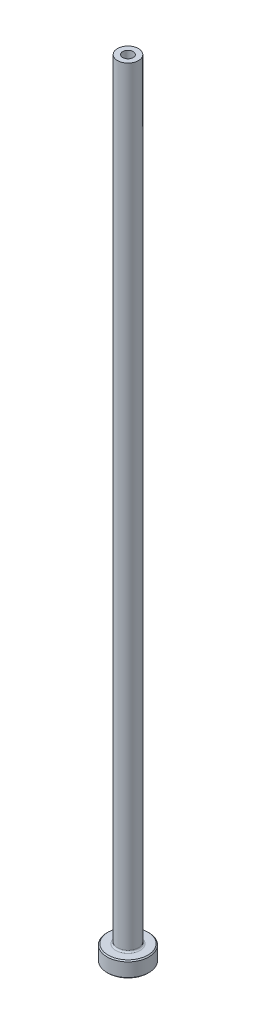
ISO-10303-21;
HEADER;
FILE_DESCRIPTION(('STEP AP214'),'2;1');
FILE_NAME('part.step','',(''),(''),'','','');
FILE_SCHEMA(('AUTOMOTIVE_DESIGN { 1 0 10303 214 1 1 1 1 }'));
ENDSEC;
DATA;
#1=APPLICATION_CONTEXT('core data for automotive mechanical design processes');
#2=APPLICATION_PROTOCOL_DEFINITION('international standard','automotive_design',2000,#1);
#3=PRODUCT_CONTEXT('',#1,'mechanical');
#4=PRODUCT('Part','Part','',(#3));
#5=PRODUCT_RELATED_PRODUCT_CATEGORY('part','',(#4));
#6=PRODUCT_DEFINITION_FORMATION('','',#4);
#7=PRODUCT_DEFINITION_CONTEXT('part definition',#1,'design');
#8=PRODUCT_DEFINITION('design','',#6,#7);
#9=PRODUCT_DEFINITION_SHAPE('','',#8);
#10=(LENGTH_UNIT() NAMED_UNIT(*) SI_UNIT(.MILLI.,.METRE.));
#11=(NAMED_UNIT(*) PLANE_ANGLE_UNIT() SI_UNIT($,.RADIAN.));
#12=(NAMED_UNIT(*) SI_UNIT($,.STERADIAN.) SOLID_ANGLE_UNIT());
#13=UNCERTAINTY_MEASURE_WITH_UNIT(LENGTH_MEASURE(1.E-05),#10,'distance_accuracy_value','');
#14=(GEOMETRIC_REPRESENTATION_CONTEXT(3) GLOBAL_UNCERTAINTY_ASSIGNED_CONTEXT((#13)) GLOBAL_UNIT_ASSIGNED_CONTEXT((#10,
#11,#12)) REPRESENTATION_CONTEXT('',''));
#15=CARTESIAN_POINT('',(0.,0.,0.));
#16=DIRECTION('',(0.,0.,1.));
#17=DIRECTION('',(1.,0.,0.));
#18=AXIS2_PLACEMENT_3D('',#15,#16,#17);
#19=CARTESIAN_POINT('',(0.,92.1876809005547,0.));
#20=DIRECTION('',(0.,1.,0.));
#21=DIRECTION('',(0.,0.,1.));
#22=AXIS2_PLACEMENT_3D('',#19,#20,#21);
#23=CYLINDRICAL_SURFACE('',#22,1.);
#24=CARTESIAN_POINT('',(0.,150.,0.));
#25=DIRECTION('',(0.,1.,0.));
#26=DIRECTION('',(0.,0.,1.));
#27=AXIS2_PLACEMENT_3D('',#24,#25,#26);
#28=CIRCLE('',#27,1.);
#29=CARTESIAN_POINT('',(0.,150.,1.));
#30=VERTEX_POINT('',#29);
#31=EDGE_CURVE('E62',#30,#30,#28,.T.);
#32=ORIENTED_EDGE('',*,*,#31,.T.);
#33=EDGE_LOOP('',(#32));
#34=FACE_BOUND('',#33,.T.);
#35=CARTESIAN_POINT('',(0.,115.,0.));
#36=DIRECTION('',(0.,1.,0.));
#37=DIRECTION('',(0.,0.,1.));
#38=AXIS2_PLACEMENT_3D('',#35,#36,#37);
#39=CIRCLE('',#38,1.);
#40=CARTESIAN_POINT('',(0.,115.,1.));
#41=VERTEX_POINT('',#40);
#42=EDGE_CURVE('E71',#41,#41,#39,.T.);
#43=ORIENTED_EDGE('',*,*,#42,.F.);
#44=EDGE_LOOP('',(#43));
#45=FACE_BOUND('',#44,.T.);
#46=ADVANCED_FACE('F30',(#34,#45),#23,.F.);
#47=CARTESIAN_POINT('',(-1.,150.,0.));
#48=DIRECTION('',(0.,1.,0.));
#49=DIRECTION('',(0.,0.,1.));
#50=AXIS2_PLACEMENT_3D('',#47,#48,#49);
#51=PLANE('',#50);
#52=CARTESIAN_POINT('',(0.,150.,0.));
#53=DIRECTION('',(0.,1.,0.));
#54=DIRECTION('',(0.,0.,1.));
#55=AXIS2_PLACEMENT_3D('',#52,#53,#54);
#56=CIRCLE('',#55,2.00000000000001);
#57=CARTESIAN_POINT('',(0.,150.,2.00000000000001));
#58=VERTEX_POINT('',#57);
#59=EDGE_CURVE('E65',#58,#58,#56,.T.);
#60=ORIENTED_EDGE('',*,*,#59,.T.);
#61=EDGE_LOOP('',(#60));
#62=FACE_BOUND('',#61,.T.);
#63=ORIENTED_EDGE('',*,*,#31,.F.);
#64=EDGE_LOOP('',(#63));
#65=FACE_BOUND('',#64,.T.);
#66=ADVANCED_FACE('F79',(#62,#65),#51,.T.);
#67=CARTESIAN_POINT('',(0.,92.1876809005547,0.));
#68=DIRECTION('',(0.,1.,0.));
#69=DIRECTION('',(0.,0.,1.));
#70=AXIS2_PLACEMENT_3D('',#67,#68,#69);
#71=CYLINDRICAL_SURFACE('',#70,2.);
#72=CARTESIAN_POINT('',(0.,3.3,0.));
#73=DIRECTION('',(0.,1.,0.));
#74=DIRECTION('',(0.,0.,1.));
#75=AXIS2_PLACEMENT_3D('',#72,#73,#74);
#76=CIRCLE('',#75,2.);
#77=CARTESIAN_POINT('',(0.,3.3,2.));
#78=VERTEX_POINT('',#77);
#79=EDGE_CURVE('E59',#78,#78,#76,.T.);
#80=ORIENTED_EDGE('',*,*,#79,.T.);
#81=EDGE_LOOP('',(#80));
#82=FACE_BOUND('',#81,.T.);
#83=ORIENTED_EDGE('',*,*,#59,.F.);
#84=EDGE_LOOP('',(#83));
#85=FACE_BOUND('',#84,.T.);
#86=ADVANCED_FACE('F85',(#82,#85),#71,.T.);
#87=CARTESIAN_POINT('',(-1.99999999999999,3.,0.));
#88=DIRECTION('',(0.,1.,0.));
#89=DIRECTION('',(0.,0.,1.));
#90=AXIS2_PLACEMENT_3D('',#87,#88,#89);
#91=PLANE('',#90);
#92=CARTESIAN_POINT('',(0.,3.,0.));
#93=DIRECTION('',(0.,1.,0.));
#94=DIRECTION('',(0.,0.,1.));
#95=AXIS2_PLACEMENT_3D('',#92,#93,#94);
#96=CIRCLE('',#95,3.8);
#97=CARTESIAN_POINT('',(0.,3.,3.8));
#98=VERTEX_POINT('',#97);
#99=EDGE_CURVE('E53',#98,#98,#96,.T.);
#100=ORIENTED_EDGE('',*,*,#99,.T.);
#101=EDGE_LOOP('',(#100));
#102=FACE_BOUND('',#101,.T.);
#103=CARTESIAN_POINT('',(0.,3.,0.));
#104=DIRECTION('',(0.,1.,0.));
#105=DIRECTION('',(0.,0.,1.));
#106=AXIS2_PLACEMENT_3D('',#103,#104,#105);
#107=CIRCLE('',#106,2.3);
#108=CARTESIAN_POINT('',(0.,3.,2.3));
#109=VERTEX_POINT('',#108);
#110=EDGE_CURVE('E56',#109,#109,#107,.F.);
#111=ORIENTED_EDGE('',*,*,#110,.T.);
#112=EDGE_LOOP('',(#111));
#113=FACE_BOUND('',#112,.T.);
#114=ADVANCED_FACE('F111',(#102,#113),#91,.T.);
#115=CARTESIAN_POINT('',(0.,92.1876809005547,0.));
#116=DIRECTION('',(0.,1.,0.));
#117=DIRECTION('',(0.,0.,1.));
#118=AXIS2_PLACEMENT_3D('',#115,#116,#117);
#119=CYLINDRICAL_SURFACE('',#118,3.99999999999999);
#120=CARTESIAN_POINT('',(0.,2.8,0.));
#121=DIRECTION('',(0.,1.,0.));
#122=DIRECTION('',(0.,0.,1.));
#123=AXIS2_PLACEMENT_3D('',#120,#121,#122);
#124=CIRCLE('',#123,3.99999999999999);
#125=CARTESIAN_POINT('',(0.,2.8,3.99999999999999));
#126=VERTEX_POINT('',#125);
#127=EDGE_CURVE('E45',#126,#126,#124,.F.);
#128=ORIENTED_EDGE('',*,*,#127,.T.);
#129=EDGE_LOOP('',(#128));
#130=FACE_BOUND('',#129,.T.);
#131=CARTESIAN_POINT('',(0.,0.20000000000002,0.));
#132=DIRECTION('',(0.,-1.,0.));
#133=DIRECTION('',(0.,0.,-1.));
#134=AXIS2_PLACEMENT_3D('',#131,#132,#133);
#135=CIRCLE('',#134,3.99999999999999);
#136=CARTESIAN_POINT('',(0.,0.20000000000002,-3.99999999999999));
#137=VERTEX_POINT('',#136);
#138=EDGE_CURVE('E50',#137,#137,#135,.F.);
#139=ORIENTED_EDGE('',*,*,#138,.T.);
#140=EDGE_LOOP('',(#139));
#141=FACE_BOUND('',#140,.T.);
#142=ADVANCED_FACE('F108',(#130,#141),#119,.T.);
#143=CARTESIAN_POINT('',(-3.99999999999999,0.,0.));
#144=DIRECTION('',(0.,-1.,0.));
#145=DIRECTION('',(0.,0.,-1.));
#146=AXIS2_PLACEMENT_3D('',#143,#144,#145);
#147=PLANE('',#146);
#148=CARTESIAN_POINT('',(0.,0.,0.));
#149=DIRECTION('',(0.,-1.,0.));
#150=DIRECTION('',(0.,0.,-1.));
#151=AXIS2_PLACEMENT_3D('',#148,#149,#150);
#152=CIRCLE('',#151,1.74999999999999);
#153=CARTESIAN_POINT('',(0.,0.,-1.74999999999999));
#154=VERTEX_POINT('',#153);
#155=EDGE_CURVE('E37',#154,#154,#152,.F.);
#156=ORIENTED_EDGE('',*,*,#155,.T.);
#157=EDGE_LOOP('',(#156));
#158=FACE_BOUND('',#157,.T.);
#159=CARTESIAN_POINT('',(0.,0.,0.));
#160=DIRECTION('',(0.,-1.,0.));
#161=DIRECTION('',(0.,0.,-1.));
#162=AXIS2_PLACEMENT_3D('',#159,#160,#161);
#163=CIRCLE('',#162,3.79999999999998);
#164=CARTESIAN_POINT('',(0.,0.,-3.79999999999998));
#165=VERTEX_POINT('',#164);
#166=EDGE_CURVE('E41',#165,#165,#163,.T.);
#167=ORIENTED_EDGE('',*,*,#166,.T.);
#168=EDGE_LOOP('',(#167));
#169=FACE_BOUND('',#168,.T.);
#170=ADVANCED_FACE('F110',(#158,#169),#147,.T.);
#171=CARTESIAN_POINT('',(0.,92.1876809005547,0.));
#172=DIRECTION('',(0.,1.,0.));
#173=DIRECTION('',(0.,0.,1.));
#174=AXIS2_PLACEMENT_3D('',#171,#172,#173);
#175=CYLINDRICAL_SURFACE('',#174,1.25);
#176=CARTESIAN_POINT('',(0.,0.499999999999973,0.));
#177=DIRECTION('',(0.,-1.,0.));
#178=DIRECTION('',(0.,0.,-1.));
#179=AXIS2_PLACEMENT_3D('',#176,#177,#178);
#180=CIRCLE('',#179,1.25);
#181=CARTESIAN_POINT('',(0.,0.499999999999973,-1.25));
#182=VERTEX_POINT('',#181);
#183=EDGE_CURVE('E10',#182,#182,#180,.T.);
#184=ORIENTED_EDGE('',*,*,#183,.T.);
#185=EDGE_LOOP('',(#184));
#186=FACE_BOUND('',#185,.T.);
#187=CARTESIAN_POINT('',(0.,103.,0.));
#188=DIRECTION('',(0.,1.,0.));
#189=DIRECTION('',(0.,0.,1.));
#190=AXIS2_PLACEMENT_3D('',#187,#188,#189);
#191=CIRCLE('',#190,1.25);
#192=CARTESIAN_POINT('',(0.,103.,1.25));
#193=VERTEX_POINT('',#192);
#194=EDGE_CURVE('E68',#193,#193,#191,.T.);
#195=ORIENTED_EDGE('',*,*,#194,.T.);
#196=EDGE_LOOP('',(#195));
#197=FACE_BOUND('',#196,.T.);
#198=ADVANCED_FACE('F118',(#186,#197),#175,.F.);
#199=CARTESIAN_POINT('',(0.,103.,0.));
#200=DIRECTION('',(0.,-1.,0.));
#201=DIRECTION('',(0.,0.,-1.));
#202=AXIS2_PLACEMENT_3D('',#199,#200,#201);
#203=CONICAL_SURFACE('',#202,1.25,0.0208303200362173);
#204=ORIENTED_EDGE('',*,*,#42,.T.);
#205=EDGE_LOOP('',(#204));
#206=FACE_BOUND('',#205,.T.);
#207=ORIENTED_EDGE('',*,*,#194,.F.);
#208=EDGE_LOOP('',(#207));
#209=FACE_BOUND('',#208,.T.);
#210=ADVANCED_FACE('F75',(#206,#209),#203,.F.);
#211=CARTESIAN_POINT('',(0.,3.3,0.));
#212=DIRECTION('',(0.,1.,0.));
#213=DIRECTION('',(0.,0.,1.));
#214=AXIS2_PLACEMENT_3D('',#211,#212,#213);
#215=TOROIDAL_SURFACE('',#214,2.3,0.3);
#216=ORIENTED_EDGE('',*,*,#110,.F.);
#217=EDGE_LOOP('',(#216));
#218=FACE_BOUND('',#217,.T.);
#219=ORIENTED_EDGE('',*,*,#79,.F.);
#220=EDGE_LOOP('',(#219));
#221=FACE_BOUND('',#220,.T.);
#222=ADVANCED_FACE('F90',(#218,#221),#215,.F.);
#223=CARTESIAN_POINT('',(0.,3.,0.));
#224=DIRECTION('',(0.,-1.,0.));
#225=DIRECTION('',(0.,0.,-1.));
#226=AXIS2_PLACEMENT_3D('',#223,#224,#225);
#227=CONICAL_SURFACE('',#226,3.8,0.785398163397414);
#228=ORIENTED_EDGE('',*,*,#127,.F.);
#229=EDGE_LOOP('',(#228));
#230=FACE_BOUND('',#229,.T.);
#231=ORIENTED_EDGE('',*,*,#99,.F.);
#232=EDGE_LOOP('',(#231));
#233=FACE_BOUND('',#232,.T.);
#234=ADVANCED_FACE('F93',(#230,#233),#227,.T.);
#235=CARTESIAN_POINT('',(0.,0.20000000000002,0.));
#236=DIRECTION('',(0.,1.,0.));
#237=DIRECTION('',(0.,0.,1.));
#238=AXIS2_PLACEMENT_3D('',#235,#236,#237);
#239=CONICAL_SURFACE('',#238,3.99999999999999,0.785398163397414);
#240=ORIENTED_EDGE('',*,*,#166,.F.);
#241=EDGE_LOOP('',(#240));
#242=FACE_BOUND('',#241,.T.);
#243=ORIENTED_EDGE('',*,*,#138,.F.);
#244=EDGE_LOOP('',(#243));
#245=FACE_BOUND('',#244,.T.);
#246=ADVANCED_FACE('F96',(#242,#245),#239,.T.);
#247=CARTESIAN_POINT('',(0.,0.,0.));
#248=DIRECTION('',(0.,-1.,0.));
#249=DIRECTION('',(0.,0.,-1.));
#250=AXIS2_PLACEMENT_3D('',#247,#248,#249);
#251=CONICAL_SURFACE('',#250,1.74999999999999,0.785398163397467);
#252=ORIENTED_EDGE('',*,*,#183,.F.);
#253=EDGE_LOOP('',(#252));
#254=FACE_BOUND('',#253,.T.);
#255=ORIENTED_EDGE('',*,*,#155,.F.);
#256=EDGE_LOOP('',(#255));
#257=FACE_BOUND('',#256,.T.);
#258=ADVANCED_FACE('F32',(#254,#257),#251,.F.);
#259=CLOSED_SHELL('',(#46,#66,#86,#114,#142,#170,#198,#210,#222,#234,#246,#258));
#260=MANIFOLD_SOLID_BREP('B2',#259);
#261=ADVANCED_BREP_SHAPE_REPRESENTATION('',(#18,#260),#14);
#262=SHAPE_DEFINITION_REPRESENTATION(#9,#261);
ENDSEC;
END-ISO-10303-21;
